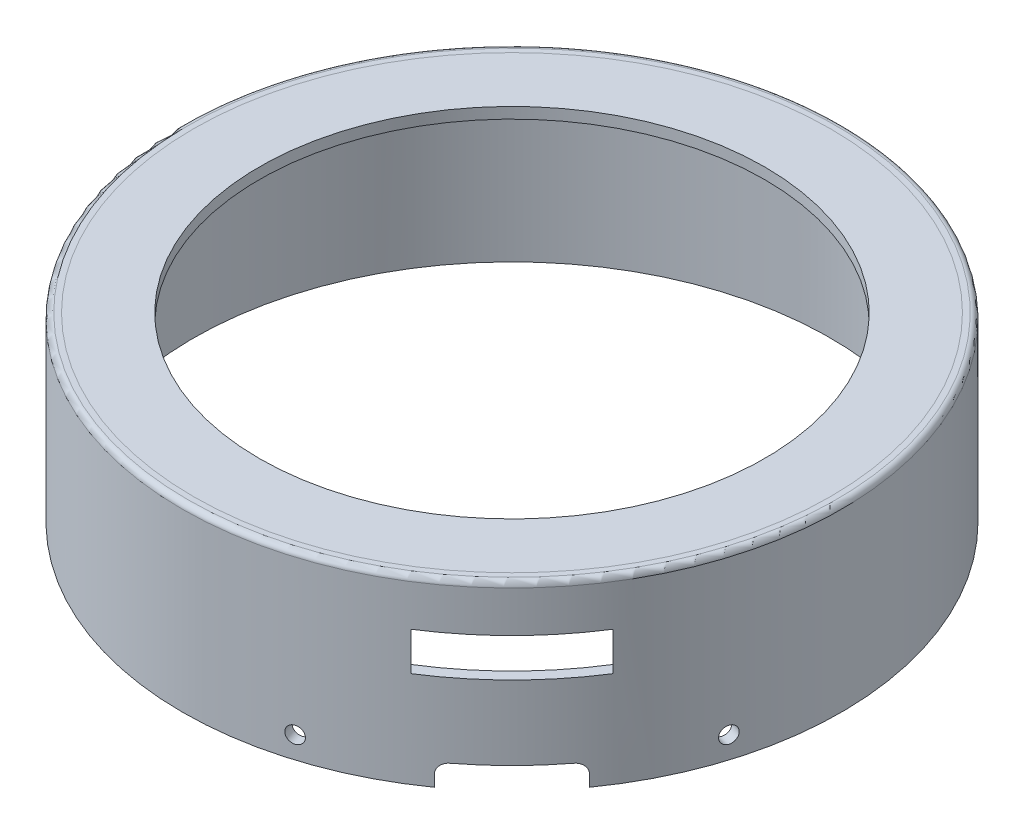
from build123d import *
from build123d.topology import SkipClean

# Parameters (mm, degrees)
SKETCH_1_R                           = 58
SKETCH_1_R_2                         = 46
EXTRUDE_1_DEPTH                      = 2
SKETCH_2_R                           = 60
SKETCH_2_R_2                         = 58
EXTRUDE_3_DEPTH                      = 33
FILLET_1_R                           = 1
CUT_EXTRUDE_1_REACH                  = 146.133
CUT_EXTRUDE_1_END_RADIUS             = 58
SKETCH_10_R                          = 1.5
CUT_EXTRUDE_1_DIRECTION_2_REACH      = 146.133
CUT_EXTRUDE_1_DIRECTION_2_END_RADIUS = 60
CUT_EXTRUDE_2_REACH                  = 146.133
CUT_EXTRUDE_2_END_RADIUS             = 58
SKETCH_11_R                          = 1.5
CUT_EXTRUDE_2_DIRECTION_2_REACH      = 146.133
CUT_EXTRUDE_2_DIRECTION_2_END_RADIUS = 60
CUT_EXTRUDE_3_REACH                  = 144.255
CUT_EXTRUDE_3_END_RADIUS             = 60
SKETCH_13_R                          = 1.5
CUT_EXTRUDE_3_DIRECTION_2_REACH      = 144.255
CUT_EXTRUDE_3_DIRECTION_2_END_RADIUS = 58
CUT_EXTRUDE_4_REACH                  = 144.255
CUT_EXTRUDE_4_END_RADIUS             = 60
SKETCH_14_R                          = 1.5
CUT_EXTRUDE_4_DIRECTION_2_REACH      = 144.255
CUT_EXTRUDE_4_DIRECTION_2_END_RADIUS = 58
CUT_EXTRUDE_5_REACH                  = 148.178
CUT_EXTRUDE_5_END_RADIUS             = 60
SKETCH_15_W                          = 26
SKETCH_15_H                          = 7
CUT_EXTRUDE_5_DIRECTION_2_REACH      = 148.178
CUT_EXTRUDE_5_DIRECTION_2_END_RADIUS = 58


with BuildPart() as part:
    # Sketch 1 → Extrude 1 (new body)
    with BuildSketch(Plane(origin=(0, 0, 0), x_dir=(1, 0, 0), z_dir=(0, 1, 0))):
        with Locations(Location((0, 0, 0), (0, 0, 270))):
            Circle(SKETCH_1_R)
        with Locations(Location((0, 0, 0), (0, 0, 270))):
            Circle(SKETCH_1_R_2, mode=Mode.SUBTRACT)
    extrude(amount=EXTRUDE_1_DEPTH)


with BuildPart() as body_2:
    # Sketch 2 → Extrude 3 (new body)
    with BuildSketch(Plane(origin=(0, 2, 0), x_dir=(1, 0, 0), z_dir=(0, 1, 0))):
        with Locations(Location((0, 0, 0), (0, 0, 270))):
            Circle(SKETCH_2_R)
        with Locations(Location((0, 0, 0), (0, 0, 270))):
            Circle(SKETCH_2_R_2, mode=Mode.SUBTRACT)
    extrude(amount=-EXTRUDE_3_DEPTH)

    # Fillet 1
    fillet_1_edges = [body_2.edges().sort_by_distance(p)[0] for p in [
        (0, 2, -60),
    ]]
    fillet(fillet_1_edges, radius=FILLET_1_R)

    # Cut-Extrude 1: up to this cylinder (the profile starts outside it)
    with SkipClean():  # the faces are left unmerged after this step: merging them gives an invalid solid
        cut_extrude_1_end = Plane(origin=(0, -7, 0), z_dir=(0, 1, 0)) * Cylinder(CUT_EXTRUDE_1_END_RADIUS, 409.266, mode=Mode.PRIVATE)
        # Sketch 10 → Cut-Extrude 1 (cut, up to the surface)
        with BuildSketch(Plane(origin=(-52.565851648, 0, -24.511859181), x_dir=(0.4226182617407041, 0, -0.9063077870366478), z_dir=(-0.9063077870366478, 0, -0.4226182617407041)), mode=Mode.PRIVATE) as cut_extrude_1_sk1:
            with Locations((0, 7)):
                Circle(SKETCH_10_R)
        cut_extrude_1_tool1 = extrude(cut_extrude_1_sk1.sketch, amount=-CUT_EXTRUDE_1_REACH, mode=Mode.PRIVATE) - cut_extrude_1_end
        add(cut_extrude_1_tool1.solids().sort_by_distance((-52.565852, -7, -24.511859))[0], mode=Mode.SUBTRACT)
        add(cut_extrude_1_tool1.solids().sort_by_distance((-52.565852, -7, -24.511859))[1], mode=Mode.SUBTRACT)

    # Cut-Extrude 1 direction 2: up to this cylinder (the profile starts inside it)
    cut_extrude_1_direction_2_end = Plane(origin=(0, -7, 0), z_dir=(0, 1, 0)) * Cylinder(CUT_EXTRUDE_1_DIRECTION_2_END_RADIUS, 413.266, mode=Mode.PRIVATE)
    # Sketch 10 → Cut-Extrude 1 direction 2 (cut, up to the surface)
    with BuildSketch(Plane(origin=(-52.565851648, 0, -24.511859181), x_dir=(0.4226182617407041, 0, -0.9063077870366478), z_dir=(-0.9063077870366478, 0, -0.4226182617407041)), mode=Mode.PRIVATE) as cut_extrude_1_direction_2_sk1:
        with Locations((0, 7)):
            Circle(SKETCH_10_R)
    cut_extrude_1_direction_2_tool1 = extrude(cut_extrude_1_direction_2_sk1.sketch, amount=CUT_EXTRUDE_1_DIRECTION_2_REACH, mode=Mode.PRIVATE) & cut_extrude_1_direction_2_end
    add(cut_extrude_1_direction_2_tool1.solids().sort_by_distance((-52.565852, -7, -24.511859))[0], mode=Mode.SUBTRACT)

    # Cut-Extrude 2: up to this cylinder (the profile starts outside it)
    with SkipClean():  # the faces are left unmerged after this step: merging them gives an invalid solid
        cut_extrude_2_end = Plane(origin=(0, -7, 0), z_dir=(0, 1, 0)) * Cylinder(CUT_EXTRUDE_2_END_RADIUS, 409.266, mode=Mode.PRIVATE)
        # Sketch 11 → Cut-Extrude 2 (cut, up to the surface)
        with BuildSketch(Plane(origin=(-24.511859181, 0, -52.565851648), x_dir=(0.9063077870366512, 0, -0.42261826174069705), z_dir=(-0.42261826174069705, 0, -0.9063077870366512)), mode=Mode.PRIVATE) as cut_extrude_2_sk1:
            with Locations((0, 7)):
                Circle(SKETCH_11_R)
        cut_extrude_2_tool1 = extrude(cut_extrude_2_sk1.sketch, amount=-CUT_EXTRUDE_2_REACH, mode=Mode.PRIVATE) - cut_extrude_2_end
        add(cut_extrude_2_tool1.solids().sort_by_distance((-24.511859, -7, -52.565852))[0], mode=Mode.SUBTRACT)
        add(cut_extrude_2_tool1.solids().sort_by_distance((-24.511859, -7, -52.565852))[1], mode=Mode.SUBTRACT)

    # Cut-Extrude 2 direction 2: up to this cylinder (the profile starts inside it)
    cut_extrude_2_direction_2_end = Plane(origin=(0, -7, 0), z_dir=(0, 1, 0)) * Cylinder(CUT_EXTRUDE_2_DIRECTION_2_END_RADIUS, 413.266, mode=Mode.PRIVATE)
    # Sketch 11 → Cut-Extrude 2 direction 2 (cut, up to the surface)
    with BuildSketch(Plane(origin=(-24.511859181, 0, -52.565851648), x_dir=(0.9063077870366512, 0, -0.42261826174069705), z_dir=(-0.42261826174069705, 0, -0.9063077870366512)), mode=Mode.PRIVATE) as cut_extrude_2_direction_2_sk1:
        with Locations((0, 7)):
            Circle(SKETCH_11_R)
    cut_extrude_2_direction_2_tool1 = extrude(cut_extrude_2_direction_2_sk1.sketch, amount=CUT_EXTRUDE_2_DIRECTION_2_REACH, mode=Mode.PRIVATE) & cut_extrude_2_direction_2_end
    add(cut_extrude_2_direction_2_tool1.solids().sort_by_distance((-24.511859, -7, -52.565852))[0], mode=Mode.SUBTRACT)

    # Cut-Extrude 3: up to this cylinder (the profile starts inside it)
    cut_extrude_3_end = Plane(origin=(0, -27, 0), z_dir=(0, 1, 0)) * Cylinder(CUT_EXTRUDE_3_END_RADIUS, 409.51, mode=Mode.PRIVATE)
    # Sketch 13 → Cut-Extrude 3 (cut, up to the surface)
    with BuildSketch(Plane(origin=(17.205499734, 0, 55.389265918), x_dir=(0.9549873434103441, 0, -0.2966465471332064), z_dir=(-0.2966465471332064, 0, -0.9549873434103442)), mode=Mode.PRIVATE) as cut_extrude_3_sk1:
        with Locations(Location((0, 27, 0), (0, 0, 180))):
            Circle(SKETCH_13_R)
    cut_extrude_3_tool1 = extrude(cut_extrude_3_sk1.sketch, amount=-CUT_EXTRUDE_3_REACH, mode=Mode.PRIVATE) & cut_extrude_3_end
    add(cut_extrude_3_tool1.solids().sort_by_distance((17.2055, -27, 55.389266))[0], mode=Mode.SUBTRACT)

    # Cut-Extrude 3 direction 2: up to this cylinder (the profile starts outside it)
    with SkipClean():  # the faces are left unmerged after this step: merging them gives an invalid solid
        cut_extrude_3_direction_2_end = Plane(origin=(0, -27, 0), z_dir=(0, 1, 0)) * Cylinder(CUT_EXTRUDE_3_DIRECTION_2_END_RADIUS, 405.51, mode=Mode.PRIVATE)
        # Sketch 13 → Cut-Extrude 3 direction 2 (cut, up to the surface)
        with BuildSketch(Plane(origin=(17.205499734, 0, 55.389265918), x_dir=(0.9549873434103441, 0, -0.2966465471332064), z_dir=(-0.2966465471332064, 0, -0.9549873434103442)), mode=Mode.PRIVATE) as cut_extrude_3_direction_2_sk1:
            with Locations(Location((0, 27, 0), (0, 0, 180))):
                Circle(SKETCH_13_R)
        cut_extrude_3_direction_2_tool1 = extrude(cut_extrude_3_direction_2_sk1.sketch, amount=CUT_EXTRUDE_3_DIRECTION_2_REACH, mode=Mode.PRIVATE) - cut_extrude_3_direction_2_end
        add(cut_extrude_3_direction_2_tool1.solids().sort_by_distance((17.2055, -27, 55.389266))[0], mode=Mode.SUBTRACT)
        add(cut_extrude_3_direction_2_tool1.solids().sort_by_distance((17.2055, -27, 55.389266))[1], mode=Mode.SUBTRACT)

    # Cut-Extrude 4: up to this cylinder (the profile starts inside it)
    cut_extrude_4_end = Plane(origin=(0, -27, 0), z_dir=(0, 1, 0)) * Cylinder(CUT_EXTRUDE_4_END_RADIUS, 409.51, mode=Mode.PRIVATE)
    # Sketch 14 → Cut-Extrude 4 (cut, up to the surface)
    with BuildSketch(Plane(origin=(55.389265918, 0, 17.205499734), x_dir=(0.29664654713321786, 0, -0.9549873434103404), z_dir=(-0.9549873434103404, 0, -0.29664654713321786)), mode=Mode.PRIVATE) as cut_extrude_4_sk1:
        with Locations(Location((0, 27, 0), (0, 0, 180))):
            Circle(SKETCH_14_R)
    cut_extrude_4_tool1 = extrude(cut_extrude_4_sk1.sketch, amount=-CUT_EXTRUDE_4_REACH, mode=Mode.PRIVATE) & cut_extrude_4_end
    add(cut_extrude_4_tool1.solids().sort_by_distance((55.389266, -27, 17.2055))[0], mode=Mode.SUBTRACT)

    # Cut-Extrude 4 direction 2: up to this cylinder (the profile starts outside it)
    with SkipClean():  # the faces are left unmerged after this step: merging them gives an invalid solid
        cut_extrude_4_direction_2_end = Plane(origin=(0, -27, 0), z_dir=(0, 1, 0)) * Cylinder(CUT_EXTRUDE_4_DIRECTION_2_END_RADIUS, 405.51, mode=Mode.PRIVATE)
        # Sketch 14 → Cut-Extrude 4 direction 2 (cut, up to the surface)
        with BuildSketch(Plane(origin=(55.389265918, 0, 17.205499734), x_dir=(0.29664654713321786, 0, -0.9549873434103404), z_dir=(-0.9549873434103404, 0, -0.29664654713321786)), mode=Mode.PRIVATE) as cut_extrude_4_direction_2_sk1:
            with Locations(Location((0, 27, 0), (0, 0, 180))):
                Circle(SKETCH_14_R)
        cut_extrude_4_direction_2_tool1 = extrude(cut_extrude_4_direction_2_sk1.sketch, amount=CUT_EXTRUDE_4_DIRECTION_2_REACH, mode=Mode.PRIVATE) - cut_extrude_4_direction_2_end
        add(cut_extrude_4_direction_2_tool1.solids().sort_by_distance((55.389266, -27, 17.2055))[0], mode=Mode.SUBTRACT)
        add(cut_extrude_4_direction_2_tool1.solids().sort_by_distance((55.389266, -27, 17.2055))[1], mode=Mode.SUBTRACT)

    # Cut-Extrude 5: up to this cylinder (the profile starts inside it)
    cut_extrude_5_end = Plane(origin=(0, -20.51927, 0), z_dir=(0, 1, 0)) * Cylinder(CUT_EXTRUDE_5_END_RADIUS, 438.39454, mode=Mode.PRIVATE)
    # Sketch 15 → Cut-Extrude 5 (cut, up to the surface)
    with BuildSketch(Plane(origin=(41.012193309, 0, 41.012193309), x_dir=(0.7071067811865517, 0, -0.7071067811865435), z_dir=(-0.7071067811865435, 0, -0.7071067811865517)), mode=Mode.PRIVATE) as cut_extrude_5_sk1:
        with BuildLine():
            Line((-10, 35), (10, 35))
            Line((10, 35), (10, 29))
            ThreePointArc((10, 29), (9.414213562, 27.585786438), (8, 27))
            Line((8, 27), (-8, 27))
            ThreePointArc((-8, 27), (-9.414213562, 27.585786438), (-10, 29))
            Line((-10, 29), (-10, 35))
        make_face()
    cut_extrude_5_tool1 = extrude(cut_extrude_5_sk1.sketch, amount=-CUT_EXTRUDE_5_REACH, mode=Mode.PRIVATE) & cut_extrude_5_end
    add(cut_extrude_5_tool1.solids().sort_by_distance((41.012193, -31.03854, 41.012193))[0], mode=Mode.SUBTRACT)
    # Sketch 15 → Cut-Extrude 5 (cut, up to the surface)
    with BuildSketch(Plane(origin=(41.012193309, 0, 41.012193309), x_dir=(0.7071067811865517, 0, -0.7071067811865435), z_dir=(-0.7071067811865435, 0, -0.7071067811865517)), mode=Mode.PRIVATE) as cut_extrude_5_sk2:
        with Locations((0, 10)):
            Rectangle(SKETCH_15_W, SKETCH_15_H)
    cut_extrude_5_tool2 = extrude(cut_extrude_5_sk2.sketch, amount=-CUT_EXTRUDE_5_REACH, mode=Mode.PRIVATE) & cut_extrude_5_end
    add(cut_extrude_5_tool2.solids().sort_by_distance((41.012193, -10, 41.012193))[0], mode=Mode.SUBTRACT)

    # Cut-Extrude 5 direction 2: up to this cylinder (the profile starts outside it)
    cut_extrude_5_direction_2_end = Plane(origin=(0, -20.51927, 0), z_dir=(0, 1, 0)) * Cylinder(CUT_EXTRUDE_5_DIRECTION_2_END_RADIUS, 434.39454, mode=Mode.PRIVATE)
    # Sketch 15 → Cut-Extrude 5 direction 2 (cut, up to the surface)
    with BuildSketch(Plane(origin=(41.012193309, 0, 41.012193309), x_dir=(0.7071067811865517, 0, -0.7071067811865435), z_dir=(-0.7071067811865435, 0, -0.7071067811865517)), mode=Mode.PRIVATE) as cut_extrude_5_direction_2_sk1:
        with BuildLine():
            Line((-10, 35), (10, 35))
            Line((10, 35), (10, 29))
            ThreePointArc((10, 29), (9.414213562, 27.585786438), (8, 27))
            Line((8, 27), (-8, 27))
            ThreePointArc((-8, 27), (-9.414213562, 27.585786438), (-10, 29))
            Line((-10, 29), (-10, 35))
        make_face()
    cut_extrude_5_direction_2_tool1 = extrude(cut_extrude_5_direction_2_sk1.sketch, amount=CUT_EXTRUDE_5_DIRECTION_2_REACH, mode=Mode.PRIVATE) - cut_extrude_5_direction_2_end
    add(cut_extrude_5_direction_2_tool1.solids().sort_by_distance((41.012193, -31.03854, 41.012193))[0], mode=Mode.SUBTRACT)
    add(cut_extrude_5_direction_2_tool1.solids().sort_by_distance((41.012193, -31.03854, 41.012193))[1], mode=Mode.SUBTRACT)
    # Sketch 15 → Cut-Extrude 5 direction 2 (cut, up to the surface)
    with BuildSketch(Plane(origin=(41.012193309, 0, 41.012193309), x_dir=(0.7071067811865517, 0, -0.7071067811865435), z_dir=(-0.7071067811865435, 0, -0.7071067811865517)), mode=Mode.PRIVATE) as cut_extrude_5_direction_2_sk2:
        with Locations((0, 10)):
            Rectangle(SKETCH_15_W, SKETCH_15_H)
    cut_extrude_5_direction_2_tool2 = extrude(cut_extrude_5_direction_2_sk2.sketch, amount=CUT_EXTRUDE_5_DIRECTION_2_REACH, mode=Mode.PRIVATE) - cut_extrude_5_direction_2_end
    add(cut_extrude_5_direction_2_tool2.solids().sort_by_distance((41.012193, -10, 41.012193))[0], mode=Mode.SUBTRACT)
    add(cut_extrude_5_direction_2_tool2.solids().sort_by_distance((41.012193, -10, 41.012193))[1], mode=Mode.SUBTRACT)


solid = Compound([part.part, body_2.part])
